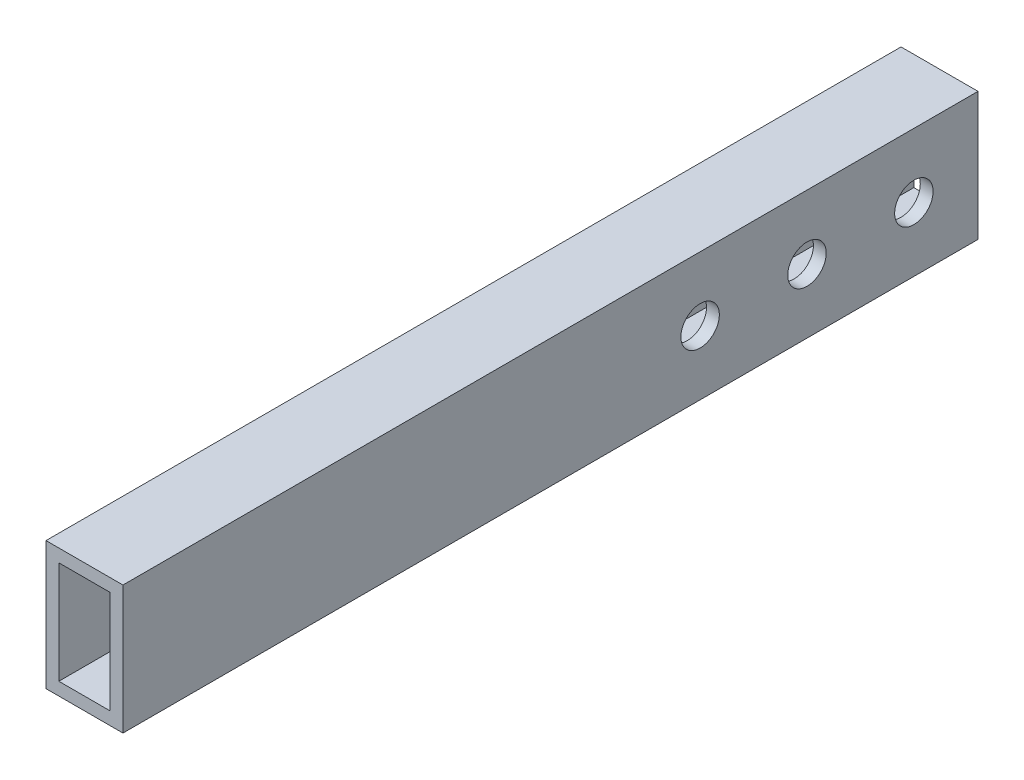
ISO-10303-21;
HEADER;
FILE_DESCRIPTION(('STEP AP214'),'2;1');
FILE_NAME('part.step','',(''),(''),'','','');
FILE_SCHEMA(('AUTOMOTIVE_DESIGN { 1 0 10303 214 1 1 1 1 }'));
ENDSEC;
DATA;
#1=APPLICATION_CONTEXT('core data for automotive mechanical design processes');
#2=APPLICATION_PROTOCOL_DEFINITION('international standard','automotive_design',2000,#1);
#3=PRODUCT_CONTEXT('',#1,'mechanical');
#4=PRODUCT('Part','Part','',(#3));
#5=PRODUCT_RELATED_PRODUCT_CATEGORY('part','',(#4));
#6=PRODUCT_DEFINITION_FORMATION('','',#4);
#7=PRODUCT_DEFINITION_CONTEXT('part definition',#1,'design');
#8=PRODUCT_DEFINITION('design','',#6,#7);
#9=PRODUCT_DEFINITION_SHAPE('','',#8);
#10=(LENGTH_UNIT() NAMED_UNIT(*) SI_UNIT(.MILLI.,.METRE.));
#11=(NAMED_UNIT(*) PLANE_ANGLE_UNIT() SI_UNIT($,.RADIAN.));
#12=(NAMED_UNIT(*) SI_UNIT($,.STERADIAN.) SOLID_ANGLE_UNIT());
#13=UNCERTAINTY_MEASURE_WITH_UNIT(LENGTH_MEASURE(1.E-05),#10,'distance_accuracy_value','');
#14=(GEOMETRIC_REPRESENTATION_CONTEXT(3) GLOBAL_UNCERTAINTY_ASSIGNED_CONTEXT((#13)) GLOBAL_UNIT_ASSIGNED_CONTEXT((#10,
#11,#12)) REPRESENTATION_CONTEXT('',''));
#15=CARTESIAN_POINT('',(0.,0.,0.));
#16=DIRECTION('',(0.,0.,1.));
#17=DIRECTION('',(1.,0.,0.));
#18=AXIS2_PLACEMENT_3D('',#15,#16,#17);
#19=CARTESIAN_POINT('',(9.,15.,200.));
#20=DIRECTION('',(-1.,0.,0.));
#21=DIRECTION('',(0.,-1.,0.));
#22=AXIS2_PLACEMENT_3D('',#19,#20,#21);
#23=PLANE('',#22);
#24=CARTESIAN_POINT('',(9.,0.,40.));
#25=DIRECTION('',(1.,0.,0.));
#26=DIRECTION('',(0.,0.,-1.));
#27=AXIS2_PLACEMENT_3D('',#24,#25,#26);
#28=CIRCLE('',#27,4.49999999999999);
#29=CARTESIAN_POINT('',(9.,0.,35.5));
#30=VERTEX_POINT('',#29);
#31=EDGE_CURVE('E375',#30,#30,#28,.T.);
#32=ORIENTED_EDGE('',*,*,#31,.F.);
#33=EDGE_LOOP('',(#32));
#34=FACE_BOUND('',#33,.T.);
#35=DIRECTION('',(0.,1.,0.));
#36=VECTOR('',#35,1.);
#37=CARTESIAN_POINT('',(9.,15.,0.));
#38=LINE('',#37,#36);
#39=CARTESIAN_POINT('',(9.,-15.,0.));
#40=VERTEX_POINT('',#39);
#41=CARTESIAN_POINT('',(9.,15.,0.));
#42=VERTEX_POINT('',#41);
#43=EDGE_CURVE('E153',#40,#42,#38,.T.);
#44=ORIENTED_EDGE('',*,*,#43,.T.);
#45=DIRECTION('',(0.,0.,-1.));
#46=VECTOR('',#45,1.);
#47=CARTESIAN_POINT('',(9.,15.,200.));
#48=LINE('',#47,#46);
#49=CARTESIAN_POINT('',(9.,15.,200.));
#50=VERTEX_POINT('',#49);
#51=EDGE_CURVE('E158',#50,#42,#48,.T.);
#52=ORIENTED_EDGE('',*,*,#51,.F.);
#53=DIRECTION('',(0.,1.,0.));
#54=VECTOR('',#53,1.);
#55=CARTESIAN_POINT('',(9.,15.,200.));
#56=LINE('',#55,#54);
#57=CARTESIAN_POINT('',(9.,-15.,200.));
#58=VERTEX_POINT('',#57);
#59=EDGE_CURVE('E144',#58,#50,#56,.T.);
#60=ORIENTED_EDGE('',*,*,#59,.F.);
#61=DIRECTION('',(0.,0.,-1.));
#62=VECTOR('',#61,1.);
#63=CARTESIAN_POINT('',(9.,-15.,200.));
#64=LINE('',#63,#62);
#65=EDGE_CURVE('E161',#58,#40,#64,.T.);
#66=ORIENTED_EDGE('',*,*,#65,.T.);
#67=EDGE_LOOP('',(#44,#52,#60,#66));
#68=FACE_BOUND('',#67,.T.);
#69=CARTESIAN_POINT('',(9.,0.,15.));
#70=DIRECTION('',(1.,0.,0.));
#71=DIRECTION('',(0.,0.,-1.));
#72=AXIS2_PLACEMENT_3D('',#69,#70,#71);
#73=CIRCLE('',#72,4.49999999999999);
#74=CARTESIAN_POINT('',(9.,0.,10.5));
#75=VERTEX_POINT('',#74);
#76=EDGE_CURVE('E171',#75,#75,#73,.T.);
#77=ORIENTED_EDGE('',*,*,#76,.F.);
#78=EDGE_LOOP('',(#77));
#79=FACE_BOUND('',#78,.T.);
#80=CARTESIAN_POINT('',(9.,0.,65.));
#81=DIRECTION('',(1.,0.,0.));
#82=DIRECTION('',(0.,0.,-1.));
#83=AXIS2_PLACEMENT_3D('',#80,#81,#82);
#84=CIRCLE('',#83,4.49999999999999);
#85=CARTESIAN_POINT('',(9.,0.,60.5));
#86=VERTEX_POINT('',#85);
#87=EDGE_CURVE('E11',#86,#86,#84,.T.);
#88=ORIENTED_EDGE('',*,*,#87,.F.);
#89=EDGE_LOOP('',(#88));
#90=FACE_BOUND('',#89,.T.);
#91=ADVANCED_FACE('F33',(#34,#68,#79,#90),#23,.F.);
#92=CARTESIAN_POINT('',(-9.,-15.,200.));
#93=DIRECTION('',(0.,0.,1.));
#94=DIRECTION('',(1.,0.,0.));
#95=AXIS2_PLACEMENT_3D('',#92,#93,#94);
#96=PLANE('',#95);
#97=DIRECTION('',(0.,-1.,0.));
#98=VECTOR('',#97,1.);
#99=CARTESIAN_POINT('',(-9.,15.,200.));
#100=LINE('',#99,#98);
#101=CARTESIAN_POINT('',(-9.,15.,200.));
#102=VERTEX_POINT('',#101);
#103=CARTESIAN_POINT('',(-9.,-15.,200.));
#104=VERTEX_POINT('',#103);
#105=EDGE_CURVE('E138',#102,#104,#100,.T.);
#106=ORIENTED_EDGE('',*,*,#105,.T.);
#107=DIRECTION('',(1.,0.,0.));
#108=VECTOR('',#107,1.);
#109=CARTESIAN_POINT('',(-9.,-15.,200.));
#110=LINE('',#109,#108);
#111=EDGE_CURVE('E141',#104,#58,#110,.T.);
#112=ORIENTED_EDGE('',*,*,#111,.T.);
#113=ORIENTED_EDGE('',*,*,#59,.T.);
#114=DIRECTION('',(-1.,0.,0.));
#115=VECTOR('',#114,1.);
#116=CARTESIAN_POINT('',(-9.,15.,200.));
#117=LINE('',#116,#115);
#118=EDGE_CURVE('E146',#50,#102,#117,.T.);
#119=ORIENTED_EDGE('',*,*,#118,.T.);
#120=EDGE_LOOP('',(#106,#112,#113,#119));
#121=FACE_BOUND('',#120,.T.);
#122=DIRECTION('',(1.,0.,0.));
#123=VECTOR('',#122,1.);
#124=CARTESIAN_POINT('',(-6.,-12.,200.));
#125=LINE('',#124,#123);
#126=CARTESIAN_POINT('',(-6.,-12.,200.));
#127=VERTEX_POINT('',#126);
#128=CARTESIAN_POINT('',(6.,-12.,200.));
#129=VERTEX_POINT('',#128);
#130=EDGE_CURVE('E107',#127,#129,#125,.T.);
#131=ORIENTED_EDGE('',*,*,#130,.F.);
#132=DIRECTION('',(0.,-1.,0.));
#133=VECTOR('',#132,1.);
#134=CARTESIAN_POINT('',(-6.,12.,200.));
#135=LINE('',#134,#133);
#136=CARTESIAN_POINT('',(-6.,12.,200.));
#137=VERTEX_POINT('',#136);
#138=EDGE_CURVE('E98',#137,#127,#135,.T.);
#139=ORIENTED_EDGE('',*,*,#138,.F.);
#140=DIRECTION('',(-1.,0.,0.));
#141=VECTOR('',#140,1.);
#142=CARTESIAN_POINT('',(-6.,12.,200.));
#143=LINE('',#142,#141);
#144=CARTESIAN_POINT('',(6.,12.,200.));
#145=VERTEX_POINT('',#144);
#146=EDGE_CURVE('E122',#145,#137,#143,.T.);
#147=ORIENTED_EDGE('',*,*,#146,.F.);
#148=DIRECTION('',(0.,1.,0.));
#149=VECTOR('',#148,1.);
#150=CARTESIAN_POINT('',(6.,12.,200.));
#151=LINE('',#150,#149);
#152=EDGE_CURVE('E120',#129,#145,#151,.T.);
#153=ORIENTED_EDGE('',*,*,#152,.F.);
#154=EDGE_LOOP('',(#131,#139,#147,#153));
#155=FACE_BOUND('',#154,.T.);
#156=ADVANCED_FACE('F119',(#121,#155),#96,.T.);
#157=CARTESIAN_POINT('',(-9.,-15.,0.));
#158=DIRECTION('',(0.,0.,1.));
#159=DIRECTION('',(1.,0.,0.));
#160=AXIS2_PLACEMENT_3D('',#157,#158,#159);
#161=PLANE('',#160);
#162=DIRECTION('',(0.,-1.,0.));
#163=VECTOR('',#162,1.);
#164=CARTESIAN_POINT('',(-9.,15.,0.));
#165=LINE('',#164,#163);
#166=CARTESIAN_POINT('',(-9.,15.,0.));
#167=VERTEX_POINT('',#166);
#168=CARTESIAN_POINT('',(-9.,-15.,0.));
#169=VERTEX_POINT('',#168);
#170=EDGE_CURVE('E115',#167,#169,#165,.T.);
#171=ORIENTED_EDGE('',*,*,#170,.F.);
#172=DIRECTION('',(-1.,0.,0.));
#173=VECTOR('',#172,1.);
#174=CARTESIAN_POINT('',(-9.,15.,0.));
#175=LINE('',#174,#173);
#176=EDGE_CURVE('E142',#42,#167,#175,.T.);
#177=ORIENTED_EDGE('',*,*,#176,.F.);
#178=ORIENTED_EDGE('',*,*,#43,.F.);
#179=DIRECTION('',(1.,0.,0.));
#180=VECTOR('',#179,1.);
#181=CARTESIAN_POINT('',(-9.,-15.,0.));
#182=LINE('',#181,#180);
#183=EDGE_CURVE('E151',#169,#40,#182,.T.);
#184=ORIENTED_EDGE('',*,*,#183,.F.);
#185=EDGE_LOOP('',(#171,#177,#178,#184));
#186=FACE_BOUND('',#185,.T.);
#187=DIRECTION('',(0.,-1.,0.));
#188=VECTOR('',#187,1.);
#189=CARTESIAN_POINT('',(-6.,12.,0.));
#190=LINE('',#189,#188);
#191=CARTESIAN_POINT('',(-6.,12.,0.));
#192=VERTEX_POINT('',#191);
#193=CARTESIAN_POINT('',(-6.,-12.,0.));
#194=VERTEX_POINT('',#193);
#195=EDGE_CURVE('E56',#192,#194,#190,.T.);
#196=ORIENTED_EDGE('',*,*,#195,.T.);
#197=DIRECTION('',(1.,0.,0.));
#198=VECTOR('',#197,1.);
#199=CARTESIAN_POINT('',(-6.,-12.,0.));
#200=LINE('',#199,#198);
#201=CARTESIAN_POINT('',(6.,-12.,0.));
#202=VERTEX_POINT('',#201);
#203=EDGE_CURVE('E114',#194,#202,#200,.T.);
#204=ORIENTED_EDGE('',*,*,#203,.T.);
#205=DIRECTION('',(0.,1.,0.));
#206=VECTOR('',#205,1.);
#207=CARTESIAN_POINT('',(6.,12.,0.));
#208=LINE('',#207,#206);
#209=CARTESIAN_POINT('',(6.,12.,0.));
#210=VERTEX_POINT('',#209);
#211=EDGE_CURVE('E130',#202,#210,#208,.T.);
#212=ORIENTED_EDGE('',*,*,#211,.T.);
#213=DIRECTION('',(-1.,0.,0.));
#214=VECTOR('',#213,1.);
#215=CARTESIAN_POINT('',(-6.,12.,0.));
#216=LINE('',#215,#214);
#217=EDGE_CURVE('E108',#210,#192,#216,.T.);
#218=ORIENTED_EDGE('',*,*,#217,.T.);
#219=EDGE_LOOP('',(#196,#204,#212,#218));
#220=FACE_BOUND('',#219,.T.);
#221=ADVANCED_FACE('F201',(#186,#220),#161,.F.);
#222=CARTESIAN_POINT('',(-9.,15.,200.));
#223=DIRECTION('',(1.,0.,0.));
#224=DIRECTION('',(0.,1.,0.));
#225=AXIS2_PLACEMENT_3D('',#222,#223,#224);
#226=PLANE('',#225);
#227=CARTESIAN_POINT('',(-9.00000000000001,0.,40.));
#228=DIRECTION('',(1.,0.,0.));
#229=DIRECTION('',(0.,0.,-1.));
#230=AXIS2_PLACEMENT_3D('',#227,#228,#229);
#231=CIRCLE('',#230,4.5);
#232=CARTESIAN_POINT('',(-9.00000000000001,0.,35.5));
#233=VERTEX_POINT('',#232);
#234=EDGE_CURVE('E362',#233,#233,#231,.T.);
#235=ORIENTED_EDGE('',*,*,#234,.T.);
#236=EDGE_LOOP('',(#235));
#237=FACE_BOUND('',#236,.T.);
#238=CARTESIAN_POINT('',(-9.00000000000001,0.,15.));
#239=DIRECTION('',(1.,0.,0.));
#240=DIRECTION('',(0.,0.,-1.));
#241=AXIS2_PLACEMENT_3D('',#238,#239,#240);
#242=CIRCLE('',#241,4.5);
#243=CARTESIAN_POINT('',(-9.00000000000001,0.,10.5));
#244=VERTEX_POINT('',#243);
#245=EDGE_CURVE('E359',#244,#244,#242,.T.);
#246=ORIENTED_EDGE('',*,*,#245,.T.);
#247=EDGE_LOOP('',(#246));
#248=FACE_BOUND('',#247,.T.);
#249=ORIENTED_EDGE('',*,*,#170,.T.);
#250=DIRECTION('',(0.,0.,-1.));
#251=VECTOR('',#250,1.);
#252=CARTESIAN_POINT('',(-9.,-15.,200.));
#253=LINE('',#252,#251);
#254=EDGE_CURVE('E164',#104,#169,#253,.T.);
#255=ORIENTED_EDGE('',*,*,#254,.F.);
#256=ORIENTED_EDGE('',*,*,#105,.F.);
#257=DIRECTION('',(0.,0.,-1.));
#258=VECTOR('',#257,1.);
#259=CARTESIAN_POINT('',(-9.,15.,200.));
#260=LINE('',#259,#258);
#261=EDGE_CURVE('E148',#102,#167,#260,.T.);
#262=ORIENTED_EDGE('',*,*,#261,.T.);
#263=EDGE_LOOP('',(#249,#255,#256,#262));
#264=FACE_BOUND('',#263,.T.);
#265=CARTESIAN_POINT('',(-9.00000000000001,0.,65.));
#266=DIRECTION('',(1.,0.,0.));
#267=DIRECTION('',(0.,0.,-1.));
#268=AXIS2_PLACEMENT_3D('',#265,#266,#267);
#269=CIRCLE('',#268,4.5);
#270=CARTESIAN_POINT('',(-9.00000000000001,0.,60.5));
#271=VERTEX_POINT('',#270);
#272=EDGE_CURVE('E174',#271,#271,#269,.T.);
#273=ORIENTED_EDGE('',*,*,#272,.T.);
#274=EDGE_LOOP('',(#273));
#275=FACE_BOUND('',#274,.T.);
#276=ADVANCED_FACE('F213',(#237,#248,#264,#275),#226,.F.);
#277=CARTESIAN_POINT('',(-9.,-15.,200.));
#278=DIRECTION('',(0.,1.,0.));
#279=DIRECTION('',(0.,0.,1.));
#280=AXIS2_PLACEMENT_3D('',#277,#278,#279);
#281=PLANE('',#280);
#282=ORIENTED_EDGE('',*,*,#183,.T.);
#283=ORIENTED_EDGE('',*,*,#65,.F.);
#284=ORIENTED_EDGE('',*,*,#111,.F.);
#285=ORIENTED_EDGE('',*,*,#254,.T.);
#286=EDGE_LOOP('',(#282,#283,#284,#285));
#287=FACE_BOUND('',#286,.T.);
#288=ADVANCED_FACE('F210',(#287),#281,.F.);
#289=CARTESIAN_POINT('',(-9.,15.,200.));
#290=DIRECTION('',(0.,-1.,0.));
#291=DIRECTION('',(0.,0.,-1.));
#292=AXIS2_PLACEMENT_3D('',#289,#290,#291);
#293=PLANE('',#292);
#294=ORIENTED_EDGE('',*,*,#176,.T.);
#295=ORIENTED_EDGE('',*,*,#261,.F.);
#296=ORIENTED_EDGE('',*,*,#118,.F.);
#297=ORIENTED_EDGE('',*,*,#51,.T.);
#298=EDGE_LOOP('',(#294,#295,#296,#297));
#299=FACE_BOUND('',#298,.T.);
#300=ADVANCED_FACE('F208',(#299),#293,.F.);
#301=CARTESIAN_POINT('',(-6.,12.,200.));
#302=DIRECTION('',(1.,0.,0.));
#303=DIRECTION('',(0.,1.,0.));
#304=AXIS2_PLACEMENT_3D('',#301,#302,#303);
#305=PLANE('',#304);
#306=CARTESIAN_POINT('',(-6.,0.,40.));
#307=DIRECTION('',(1.,0.,0.));
#308=DIRECTION('',(0.,1.,0.));
#309=AXIS2_PLACEMENT_3D('',#306,#307,#308);
#310=CIRCLE('',#309,4.49999999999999);
#311=CARTESIAN_POINT('',(-6.,4.49999999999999,40.));
#312=VERTEX_POINT('',#311);
#313=EDGE_CURVE('E372',#312,#312,#310,.T.);
#314=ORIENTED_EDGE('',*,*,#313,.F.);
#315=EDGE_LOOP('',(#314));
#316=FACE_BOUND('',#315,.T.);
#317=CARTESIAN_POINT('',(-6.,0.,15.));
#318=DIRECTION('',(1.,0.,0.));
#319=DIRECTION('',(0.,1.,0.));
#320=AXIS2_PLACEMENT_3D('',#317,#318,#319);
#321=CIRCLE('',#320,4.49999999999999);
#322=CARTESIAN_POINT('',(-6.,4.49999999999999,15.));
#323=VERTEX_POINT('',#322);
#324=EDGE_CURVE('E128',#323,#323,#321,.T.);
#325=ORIENTED_EDGE('',*,*,#324,.F.);
#326=EDGE_LOOP('',(#325));
#327=FACE_BOUND('',#326,.T.);
#328=ORIENTED_EDGE('',*,*,#195,.F.);
#329=DIRECTION('',(0.,0.,-1.));
#330=VECTOR('',#329,1.);
#331=CARTESIAN_POINT('',(-6.,12.,200.));
#332=LINE('',#331,#330);
#333=EDGE_CURVE('E103',#137,#192,#332,.T.);
#334=ORIENTED_EDGE('',*,*,#333,.F.);
#335=ORIENTED_EDGE('',*,*,#138,.T.);
#336=DIRECTION('',(0.,0.,-1.));
#337=VECTOR('',#336,1.);
#338=CARTESIAN_POINT('',(-6.,-12.,200.));
#339=LINE('',#338,#337);
#340=EDGE_CURVE('E102',#127,#194,#339,.T.);
#341=ORIENTED_EDGE('',*,*,#340,.T.);
#342=EDGE_LOOP('',(#328,#334,#335,#341));
#343=FACE_BOUND('',#342,.T.);
#344=CARTESIAN_POINT('',(-6.,0.,65.));
#345=DIRECTION('',(1.,0.,0.));
#346=DIRECTION('',(0.,1.,0.));
#347=AXIS2_PLACEMENT_3D('',#344,#345,#346);
#348=CIRCLE('',#347,4.49999999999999);
#349=CARTESIAN_POINT('',(-6.,4.49999999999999,65.));
#350=VERTEX_POINT('',#349);
#351=EDGE_CURVE('E167',#350,#350,#348,.T.);
#352=ORIENTED_EDGE('',*,*,#351,.F.);
#353=EDGE_LOOP('',(#352));
#354=FACE_BOUND('',#353,.T.);
#355=ADVANCED_FACE('F100',(#316,#327,#343,#354),#305,.T.);
#356=CARTESIAN_POINT('',(-6.,-12.,200.));
#357=DIRECTION('',(0.,1.,0.));
#358=DIRECTION('',(0.,0.,1.));
#359=AXIS2_PLACEMENT_3D('',#356,#357,#358);
#360=PLANE('',#359);
#361=ORIENTED_EDGE('',*,*,#203,.F.);
#362=ORIENTED_EDGE('',*,*,#340,.F.);
#363=ORIENTED_EDGE('',*,*,#130,.T.);
#364=DIRECTION('',(0.,0.,-1.));
#365=VECTOR('',#364,1.);
#366=CARTESIAN_POINT('',(6.,-12.,200.));
#367=LINE('',#366,#365);
#368=EDGE_CURVE('E116',#129,#202,#367,.T.);
#369=ORIENTED_EDGE('',*,*,#368,.T.);
#370=EDGE_LOOP('',(#361,#362,#363,#369));
#371=FACE_BOUND('',#370,.T.);
#372=ADVANCED_FACE('F111',(#371),#360,.T.);
#373=CARTESIAN_POINT('',(6.,12.,200.));
#374=DIRECTION('',(-1.,0.,0.));
#375=DIRECTION('',(0.,-1.,0.));
#376=AXIS2_PLACEMENT_3D('',#373,#374,#375);
#377=PLANE('',#376);
#378=CARTESIAN_POINT('',(6.,0.,40.));
#379=DIRECTION('',(-1.,0.,0.));
#380=DIRECTION('',(0.,-1.,0.));
#381=AXIS2_PLACEMENT_3D('',#378,#379,#380);
#382=CIRCLE('',#381,4.49999999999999);
#383=CARTESIAN_POINT('',(6.,-4.49999999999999,40.));
#384=VERTEX_POINT('',#383);
#385=EDGE_CURVE('E378',#384,#384,#382,.T.);
#386=ORIENTED_EDGE('',*,*,#385,.F.);
#387=EDGE_LOOP('',(#386));
#388=FACE_BOUND('',#387,.T.);
#389=CARTESIAN_POINT('',(6.,0.,15.));
#390=DIRECTION('',(-1.,0.,0.));
#391=DIRECTION('',(0.,-1.,0.));
#392=AXIS2_PLACEMENT_3D('',#389,#390,#391);
#393=CIRCLE('',#392,4.49999999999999);
#394=CARTESIAN_POINT('',(6.,-4.49999999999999,15.));
#395=VERTEX_POINT('',#394);
#396=EDGE_CURVE('E168',#395,#395,#393,.T.);
#397=ORIENTED_EDGE('',*,*,#396,.F.);
#398=EDGE_LOOP('',(#397));
#399=FACE_BOUND('',#398,.T.);
#400=ORIENTED_EDGE('',*,*,#211,.F.);
#401=ORIENTED_EDGE('',*,*,#368,.F.);
#402=ORIENTED_EDGE('',*,*,#152,.T.);
#403=DIRECTION('',(0.,0.,-1.));
#404=VECTOR('',#403,1.);
#405=CARTESIAN_POINT('',(6.,12.,200.));
#406=LINE('',#405,#404);
#407=EDGE_CURVE('E48',#145,#210,#406,.T.);
#408=ORIENTED_EDGE('',*,*,#407,.T.);
#409=EDGE_LOOP('',(#400,#401,#402,#408));
#410=FACE_BOUND('',#409,.T.);
#411=CARTESIAN_POINT('',(6.,0.,65.));
#412=DIRECTION('',(-1.,0.,0.));
#413=DIRECTION('',(0.,-1.,0.));
#414=AXIS2_PLACEMENT_3D('',#411,#412,#413);
#415=CIRCLE('',#414,4.49999999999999);
#416=CARTESIAN_POINT('',(6.,-4.49999999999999,65.));
#417=VERTEX_POINT('',#416);
#418=EDGE_CURVE('E41',#417,#417,#415,.T.);
#419=ORIENTED_EDGE('',*,*,#418,.F.);
#420=EDGE_LOOP('',(#419));
#421=FACE_BOUND('',#420,.T.);
#422=ADVANCED_FACE('F181',(#388,#399,#410,#421),#377,.T.);
#423=CARTESIAN_POINT('',(-6.,12.,200.));
#424=DIRECTION('',(0.,-1.,0.));
#425=DIRECTION('',(0.,0.,-1.));
#426=AXIS2_PLACEMENT_3D('',#423,#424,#425);
#427=PLANE('',#426);
#428=ORIENTED_EDGE('',*,*,#217,.F.);
#429=ORIENTED_EDGE('',*,*,#407,.F.);
#430=ORIENTED_EDGE('',*,*,#146,.T.);
#431=ORIENTED_EDGE('',*,*,#333,.T.);
#432=EDGE_LOOP('',(#428,#429,#430,#431));
#433=FACE_BOUND('',#432,.T.);
#434=ADVANCED_FACE('F183',(#433),#427,.T.);
#435=CARTESIAN_POINT('',(9.,0.,15.));
#436=DIRECTION('',(1.,0.,0.));
#437=DIRECTION('',(0.,0.,-1.));
#438=AXIS2_PLACEMENT_3D('',#435,#436,#437);
#439=CYLINDRICAL_SURFACE('',#438,4.49999999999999);
#440=ORIENTED_EDGE('',*,*,#396,.T.);
#441=EDGE_LOOP('',(#440));
#442=FACE_BOUND('',#441,.T.);
#443=ORIENTED_EDGE('',*,*,#76,.T.);
#444=EDGE_LOOP('',(#443));
#445=FACE_BOUND('',#444,.T.);
#446=ADVANCED_FACE('F190',(#442,#445),#439,.F.);
#447=ORIENTED_EDGE('',*,*,#324,.T.);
#448=EDGE_LOOP('',(#447));
#449=FACE_BOUND('',#448,.T.);
#450=ORIENTED_EDGE('',*,*,#245,.F.);
#451=EDGE_LOOP('',(#450));
#452=FACE_BOUND('',#451,.T.);
#453=ADVANCED_FACE('F228',(#449,#452),#439,.F.);
#454=CARTESIAN_POINT('',(9.,0.,40.));
#455=DIRECTION('',(1.,0.,0.));
#456=DIRECTION('',(0.,0.,-1.));
#457=AXIS2_PLACEMENT_3D('',#454,#455,#456);
#458=CYLINDRICAL_SURFACE('',#457,4.49999999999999);
#459=ORIENTED_EDGE('',*,*,#313,.T.);
#460=EDGE_LOOP('',(#459));
#461=FACE_BOUND('',#460,.T.);
#462=ORIENTED_EDGE('',*,*,#234,.F.);
#463=EDGE_LOOP('',(#462));
#464=FACE_BOUND('',#463,.T.);
#465=ADVANCED_FACE('F220',(#461,#464),#458,.F.);
#466=CARTESIAN_POINT('',(9.,0.,65.));
#467=DIRECTION('',(1.,0.,0.));
#468=DIRECTION('',(0.,0.,-1.));
#469=AXIS2_PLACEMENT_3D('',#466,#467,#468);
#470=CYLINDRICAL_SURFACE('',#469,4.49999999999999);
#471=ORIENTED_EDGE('',*,*,#351,.T.);
#472=EDGE_LOOP('',(#471));
#473=FACE_BOUND('',#472,.T.);
#474=ORIENTED_EDGE('',*,*,#272,.F.);
#475=EDGE_LOOP('',(#474));
#476=FACE_BOUND('',#475,.T.);
#477=ADVANCED_FACE('F217',(#473,#476),#470,.F.);
#478=CARTESIAN_POINT('',(9.,0.,40.));
#479=DIRECTION('',(1.,0.,0.));
#480=DIRECTION('',(0.,0.,-1.));
#481=AXIS2_PLACEMENT_3D('',#478,#479,#480);
#482=CYLINDRICAL_SURFACE('',#481,4.49999999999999);
#483=ORIENTED_EDGE('',*,*,#385,.T.);
#484=EDGE_LOOP('',(#483));
#485=FACE_BOUND('',#484,.T.);
#486=ORIENTED_EDGE('',*,*,#31,.T.);
#487=EDGE_LOOP('',(#486));
#488=FACE_BOUND('',#487,.T.);
#489=ADVANCED_FACE('F219',(#485,#488),#482,.F.);
#490=CARTESIAN_POINT('',(9.,0.,65.));
#491=DIRECTION('',(1.,0.,0.));
#492=DIRECTION('',(0.,0.,-1.));
#493=AXIS2_PLACEMENT_3D('',#490,#491,#492);
#494=CYLINDRICAL_SURFACE('',#493,4.49999999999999);
#495=ORIENTED_EDGE('',*,*,#418,.T.);
#496=EDGE_LOOP('',(#495));
#497=FACE_BOUND('',#496,.T.);
#498=ORIENTED_EDGE('',*,*,#87,.T.);
#499=EDGE_LOOP('',(#498));
#500=FACE_BOUND('',#499,.T.);
#501=ADVANCED_FACE('F35',(#497,#500),#494,.F.);
#502=CLOSED_SHELL('',(#91,#156,#221,#276,#288,#300,#355,#372,#422,#434,#446,#453,#465,#477,#489,#501));
#503=MANIFOLD_SOLID_BREP('B2',#502);
#504=ADVANCED_BREP_SHAPE_REPRESENTATION('',(#18,#503),#14);
#505=SHAPE_DEFINITION_REPRESENTATION(#9,#504);
ENDSEC;
END-ISO-10303-21;
